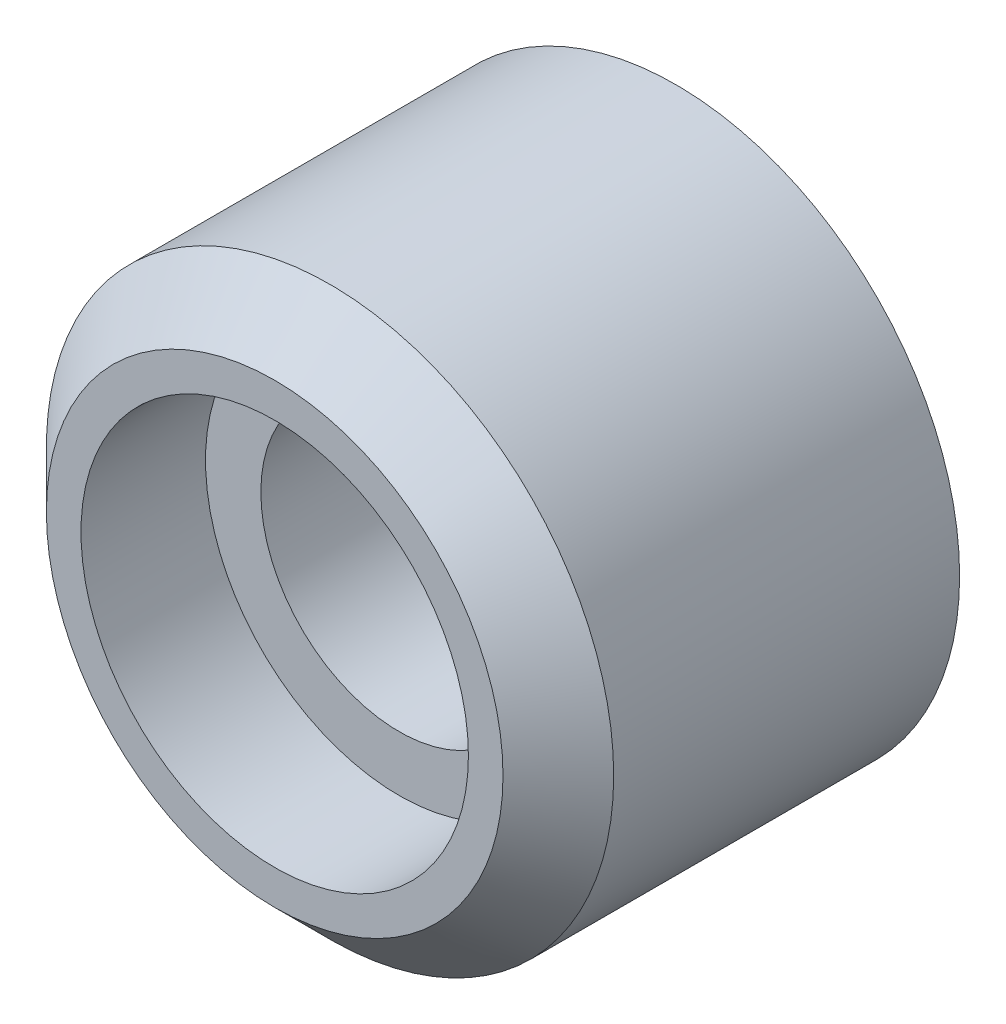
from build123d import *

# Parameters (mm, degrees)
SKIZZE1_R                       = 10.25
AUFSATZ_LINEAR_AUSTRAGEN1_DEPTH = 14.5
SKIZZE2_R                       = 5
SCHNITT_LINEAR_AUSTRAGEN1_DEPTH = 21.503048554
SKIZZE3_R                       = 7
SCHNITT_LINEAR_AUSTRAGEN2_DEPTH = 4.5
FASE1_SIZE                      = 2


with BuildPart() as part:
    # Skizze1 → Aufsatz-Linear austragen1 (new body)
    with BuildSketch(Plane.XY):
        Circle(SKIZZE1_R)
    extrude(amount=-AUFSATZ_LINEAR_AUSTRAGEN1_DEPTH)

    # Skizze2 → Schnitt-Linear austragen1 (cut, through all)
    with BuildSketch(Plane.XY):
        Circle(SKIZZE2_R)
    extrude(amount=-SCHNITT_LINEAR_AUSTRAGEN1_DEPTH, mode=Mode.SUBTRACT)

    # Skizze3 → Schnitt-Linear austragen2 (cut)
    with BuildSketch(Plane.XY):
        Circle(SKIZZE3_R)
    extrude(amount=-SCHNITT_LINEAR_AUSTRAGEN2_DEPTH, mode=Mode.SUBTRACT)

    # Fase1
    fase1_edges = [part.edges().sort_by_distance(p)[0] for p in [
        (-10.25, 0, 0),
    ]]
    chamfer(fase1_edges, length=FASE1_SIZE)


solid = part.part
